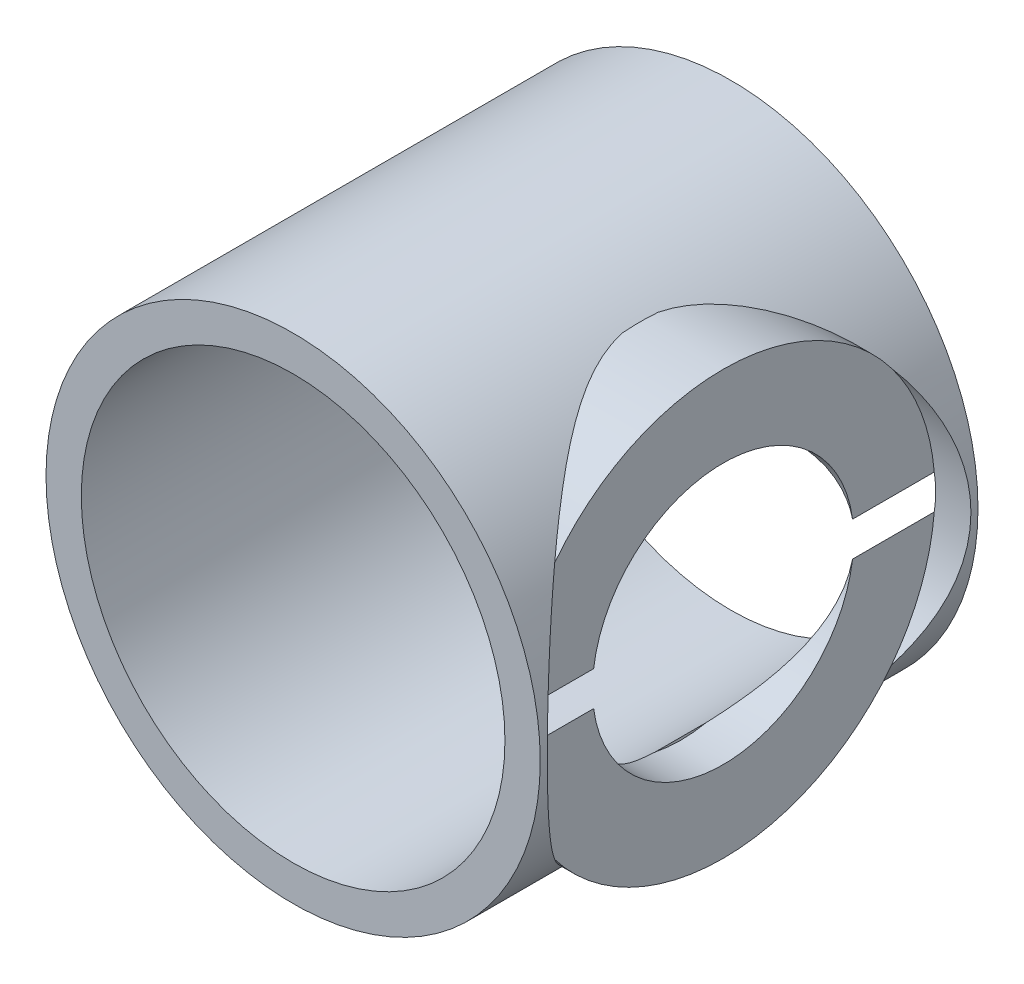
ISO-10303-21;
HEADER;
FILE_DESCRIPTION(('STEP AP214'),'2;1');
FILE_NAME('part.step','',(''),(''),'','','');
FILE_SCHEMA(('AUTOMOTIVE_DESIGN { 1 0 10303 214 1 1 1 1 }'));
ENDSEC;
DATA;
#1=APPLICATION_CONTEXT('core data for automotive mechanical design processes');
#2=APPLICATION_PROTOCOL_DEFINITION('international standard','automotive_design',2000,#1);
#3=PRODUCT_CONTEXT('',#1,'mechanical');
#4=PRODUCT('Part','Part','',(#3));
#5=PRODUCT_RELATED_PRODUCT_CATEGORY('part','',(#4));
#6=PRODUCT_DEFINITION_FORMATION('','',#4);
#7=PRODUCT_DEFINITION_CONTEXT('part definition',#1,'design');
#8=PRODUCT_DEFINITION('design','',#6,#7);
#9=PRODUCT_DEFINITION_SHAPE('','',#8);
#10=(LENGTH_UNIT() NAMED_UNIT(*) SI_UNIT(.MILLI.,.METRE.));
#11=(NAMED_UNIT(*) PLANE_ANGLE_UNIT() SI_UNIT($,.RADIAN.));
#12=(NAMED_UNIT(*) SI_UNIT($,.STERADIAN.) SOLID_ANGLE_UNIT());
#13=UNCERTAINTY_MEASURE_WITH_UNIT(LENGTH_MEASURE(1.E-05),#10,'distance_accuracy_value','');
#14=(GEOMETRIC_REPRESENTATION_CONTEXT(3) GLOBAL_UNCERTAINTY_ASSIGNED_CONTEXT((#13)) GLOBAL_UNIT_ASSIGNED_CONTEXT((#10,
#11,#12)) REPRESENTATION_CONTEXT('',''));
#15=CARTESIAN_POINT('',(0.,0.,0.));
#16=DIRECTION('',(0.,0.,1.));
#17=DIRECTION('',(1.,0.,0.));
#18=AXIS2_PLACEMENT_3D('',#15,#16,#17);
#19=CARTESIAN_POINT('',(0.,0.,78.74));
#20=DIRECTION('',(0.,0.,-1.));
#21=DIRECTION('',(-1.,0.,0.));
#22=AXIS2_PLACEMENT_3D('',#19,#20,#21);
#23=CYLINDRICAL_SURFACE('',#22,38.1);
#24=CARTESIAN_POINT('',(30.353,-23.0283605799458,44.0293598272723));
#25=CARTESIAN_POINT('',(30.4024052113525,-22.9632314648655,44.3512633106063));
#26=CARTESIAN_POINT('',(30.4565027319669,-22.8915020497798,44.6710385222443));
#27=CARTESIAN_POINT('',(30.5733714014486,-22.7351838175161,45.3057598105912));
#28=CARTESIAN_POINT('',(30.6361408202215,-22.6505975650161,45.620706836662));
#29=CARTESIAN_POINT('',(30.8362124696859,-22.3783092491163,46.5566515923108));
#30=CARTESIAN_POINT('',(30.9854386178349,-22.1718697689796,47.1697730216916));
#31=CARTESIAN_POINT('',(31.3084596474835,-21.7133241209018,48.3675442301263));
#32=CARTESIAN_POINT('',(31.482112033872,-21.4614805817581,48.9523344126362));
#33=CARTESIAN_POINT('',(31.8485031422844,-20.9139035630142,50.0949775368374));
#34=CARTESIAN_POINT('',(32.0412487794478,-20.6181541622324,50.6528206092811));
#35=CARTESIAN_POINT('',(32.438775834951,-19.9868508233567,51.7365700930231));
#36=CARTESIAN_POINT('',(32.6434879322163,-19.65151651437,52.2626303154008));
#37=CARTESIAN_POINT('',(33.0603795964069,-18.9417703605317,53.2844267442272));
#38=CARTESIAN_POINT('',(33.272558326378,-18.5673628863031,53.7801663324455));
#39=CARTESIAN_POINT('',(33.6998635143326,-17.7800539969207,54.7411262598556));
#40=CARTESIAN_POINT('',(33.9149962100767,-17.3670548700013,55.2062637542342));
#41=CARTESIAN_POINT('',(34.3428364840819,-16.5048844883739,56.1029214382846));
#42=CARTESIAN_POINT('',(34.5555440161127,-16.0557125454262,56.5344409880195));
#43=CARTESIAN_POINT('',(34.9982966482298,-15.0683419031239,57.4100840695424));
#44=CARTESIAN_POINT('',(35.2274810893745,-14.5258647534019,57.8498368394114));
#45=CARTESIAN_POINT('',(35.6710160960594,-13.3998061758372,58.6819215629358));
#46=CARTESIAN_POINT('',(35.8853643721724,-12.8162184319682,59.0742462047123));
#47=CARTESIAN_POINT('',(36.2927334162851,-11.6124983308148,59.8067291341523));
#48=CARTESIAN_POINT('',(36.4858119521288,-10.9924723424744,60.1470297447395));
#49=CARTESIAN_POINT('',(36.8456946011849,-9.71815649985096,60.7727041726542));
#50=CARTESIAN_POINT('',(37.0125100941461,-9.06388165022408,61.0581017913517));
#51=CARTESIAN_POINT('',(37.2586629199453,-7.97423087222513,61.474971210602));
#52=CARTESIAN_POINT('',(37.3474917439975,-7.54771504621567,61.6242634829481));
#53=CARTESIAN_POINT('',(37.5116038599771,-6.68449509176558,61.898593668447));
#54=CARTESIAN_POINT('',(37.5868912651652,-6.24779410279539,62.0236389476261));
#55=CARTESIAN_POINT('',(37.723083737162,-5.36459865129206,62.2489036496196));
#56=CARTESIAN_POINT('',(37.7839513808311,-4.91808192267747,62.34905850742));
#57=CARTESIAN_POINT('',(37.8902652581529,-4.01796512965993,62.5234372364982));
#58=CARTESIAN_POINT('',(37.9357034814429,-3.56436151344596,62.597647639));
#59=CARTESIAN_POINT('',(37.973,-3.10825851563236,62.6584897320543));
#60=B_SPLINE_CURVE_WITH_KNOTS('',3,(#24,#25,#26,#27,#28,#29,#30,#31,#32,#33,#34,#35,#36,#37,#38,
#39,#40,#41,#42,#43,#44,#45,#46,#47,#48,#49,#50,#51,#52,#53,#54,#55,#56,#57,#58,#59),
.UNSPECIFIED.,.F.,.F.,(4,2,2,2,2,2,2,2,2,2,2,2,2,2,2,2,2,4),(0.,0.996131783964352,
1.99206512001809,3.9807851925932,5.95835096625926,7.93663560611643,9.90441886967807,
11.8719822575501,13.8446698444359,15.8173949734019,18.0195481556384,20.2220404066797,
22.4183950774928,24.6137954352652,25.9945659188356,27.374916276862,28.758810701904,
30.1434224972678),.UNSPECIFIED.);
#61=CARTESIAN_POINT('',(30.353,-23.0283605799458,44.0293598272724));
#62=VERTEX_POINT('',#61);
#63=CARTESIAN_POINT('',(37.973,-3.10825851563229,62.6584897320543));
#64=VERTEX_POINT('',#63);
#65=EDGE_CURVE('E49',#62,#64,#60,.T.);
#66=ORIENTED_EDGE('',*,*,#65,.F.);
#67=DIRECTION('',(0.,0.,-1.));
#68=VECTOR('',#67,1.);
#69=CARTESIAN_POINT('',(30.353,-23.0283605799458,78.74));
#70=LINE('',#69,#68);
#71=CARTESIAN_POINT('',(30.353,-23.0283605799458,34.7106401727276));
#72=VERTEX_POINT('',#71);
#73=EDGE_CURVE('E11',#62,#72,#70,.T.);
#74=ORIENTED_EDGE('',*,*,#73,.T.);
#75=CARTESIAN_POINT('',(37.973,-3.10825851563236,16.0815102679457));
#76=CARTESIAN_POINT('',(37.9474390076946,-3.4206348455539,16.1231949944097));
#77=CARTESIAN_POINT('',(37.9180758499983,-3.73185335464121,16.1711367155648));
#78=CARTESIAN_POINT('',(37.8519848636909,-4.35133286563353,16.2793158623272));
#79=CARTESIAN_POINT('',(37.8152576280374,-4.65959410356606,16.3395522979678));
#80=CARTESIAN_POINT('',(37.7347056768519,-5.2723263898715,16.4720571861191));
#81=CARTESIAN_POINT('',(37.6908865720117,-5.57680023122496,16.5443161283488));
#82=CARTESIAN_POINT('',(37.5964278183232,-6.1816134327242,16.7006313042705));
#83=CARTESIAN_POINT('',(37.54578805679,-6.48195272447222,16.7846877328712));
#84=CARTESIAN_POINT('',(37.3848489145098,-7.3718718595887,17.05291150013));
#85=CARTESIAN_POINT('',(37.2649491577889,-7.95471276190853,17.2540815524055));
#86=CARTESIAN_POINT('',(37.0023588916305,-9.09835016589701,17.6994691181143));
#87=CARTESIAN_POINT('',(36.859664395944,-9.65914279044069,17.9436941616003));
#88=CARTESIAN_POINT('',(36.555205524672,-10.754011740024,18.4718067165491));
#89=CARTESIAN_POINT('',(36.3935021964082,-11.2881661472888,18.7555677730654));
#90=CARTESIAN_POINT('',(36.0541211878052,-12.3292398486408,19.3608155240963));
#91=CARTESIAN_POINT('',(35.8764441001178,-12.8361601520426,19.6823008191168));
#92=CARTESIAN_POINT('',(35.5082433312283,-13.8221669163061,20.3615275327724));
#93=CARTESIAN_POINT('',(35.3176887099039,-14.3011807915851,20.7193573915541));
#94=CARTESIAN_POINT('',(34.9278715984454,-15.2284866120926,21.4685039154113));
#95=CARTESIAN_POINT('',(34.7286085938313,-15.6767767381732,21.8598225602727));
#96=CARTESIAN_POINT('',(34.3043537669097,-16.5860895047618,22.7162879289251));
#97=CARTESIAN_POINT('',(34.078834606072,-17.0436224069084,23.1848834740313));
#98=CARTESIAN_POINT('',(33.6273461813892,-17.9179719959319,24.1585081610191));
#99=CARTESIAN_POINT('',(33.4013768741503,-18.3347845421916,24.6635409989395));
#100=CARTESIAN_POINT('',(32.9552465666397,-19.1250409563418,25.7070815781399));
#101=CARTESIAN_POINT('',(32.7350746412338,-19.4985717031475,26.2455188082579));
#102=CARTESIAN_POINT('',(32.3062375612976,-20.2011475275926,27.3550223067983));
#103=CARTESIAN_POINT('',(32.0975710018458,-20.5301980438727,27.9260845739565));
#104=CARTESIAN_POINT('',(31.7349808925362,-21.0853009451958,28.9913344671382));
#105=CARTESIAN_POINT('',(31.5780337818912,-21.3191772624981,29.4804269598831));
#106=CARTESIAN_POINT('',(31.280083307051,-21.753982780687,30.4775874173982));
#107=CARTESIAN_POINT('',(31.1390742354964,-21.9549237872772,30.9856485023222));
#108=CARTESIAN_POINT('',(30.876396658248,-22.3228513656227,32.0209879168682));
#109=CARTESIAN_POINT('',(30.7547975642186,-22.4897166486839,32.5483272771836));
#110=CARTESIAN_POINT('',(30.5351932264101,-22.7869553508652,33.6185635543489));
#111=CARTESIAN_POINT('',(30.4372124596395,-22.9172909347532,34.1614759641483));
#112=CARTESIAN_POINT('',(30.353,-23.0283605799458,34.7106401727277));
#113=B_SPLINE_CURVE_WITH_KNOTS('',3,(#75,#76,#77,#78,#79,#80,#81,#82,#83,#84,#85,#86,#87,#88,
#89,#90,#91,#92,#93,#94,#95,#96,#97,#98,#99,#100,#101,#102,#103,#104,#105,#106,#107,#108,#109,
#110,#111,#112),.UNSPECIFIED.,.F.,.F.,(4,2,2,2,2,2,2,2,2,2,2,2,2,2,2,2,2,2,4),(0.,
0.948435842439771,1.89679534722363,2.84440819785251,3.79203670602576,5.67384384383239,
7.55598042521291,9.43222963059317,11.3084092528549,13.1892689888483,15.0702399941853,
17.1460173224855,19.2220055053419,21.2937516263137,23.365244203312,25.057044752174,
26.7482375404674,28.4453488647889,30.1442115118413),.UNSPECIFIED.);
#114=CARTESIAN_POINT('',(37.973,-3.10825851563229,16.0815102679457));
#115=VERTEX_POINT('',#114);
#116=EDGE_CURVE('E126',#115,#72,#113,.T.);
#117=ORIENTED_EDGE('',*,*,#116,.F.);
#118=DIRECTION('',(0.,0.,-1.));
#119=VECTOR('',#118,1.);
#120=CARTESIAN_POINT('',(37.973,-3.10825851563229,78.74));
#121=LINE('',#120,#119);
#122=CARTESIAN_POINT('',(37.973,-3.10825851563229,1.39700000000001));
#123=VERTEX_POINT('',#122);
#124=EDGE_CURVE('E173',#115,#123,#121,.T.);
#125=ORIENTED_EDGE('',*,*,#124,.T.);
#126=CARTESIAN_POINT('',(0.,0.,39.37));
#127=DIRECTION('',(-0.707106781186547,0.,-0.707106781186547));
#128=DIRECTION('',(0.707106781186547,0.,-0.707106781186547));
#129=AXIS2_PLACEMENT_3D('',#126,#127,#128);
#130=ELLIPSE('',#129,53.8815367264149,38.1);
#131=CARTESIAN_POINT('',(37.973,3.10825851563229,1.39700000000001));
#132=VERTEX_POINT('',#131);
#133=EDGE_CURVE('E180',#132,#123,#130,.T.);
#134=ORIENTED_EDGE('',*,*,#133,.F.);
#135=DIRECTION('',(0.,0.,-1.));
#136=VECTOR('',#135,1.);
#137=CARTESIAN_POINT('',(37.973,3.10825851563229,78.74));
#138=LINE('',#137,#136);
#139=CARTESIAN_POINT('',(37.973,3.10825851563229,16.0815102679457));
#140=VERTEX_POINT('',#139);
#141=EDGE_CURVE('E125',#132,#140,#138,.F.);
#142=ORIENTED_EDGE('',*,*,#141,.T.);
#143=CARTESIAN_POINT('',(30.353,23.0283605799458,34.7106401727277));
#144=CARTESIAN_POINT('',(30.4024052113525,22.9632314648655,34.3887366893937));
#145=CARTESIAN_POINT('',(30.4565027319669,22.8915020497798,34.0689614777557));
#146=CARTESIAN_POINT('',(30.5733714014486,22.7351838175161,33.4342401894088));
#147=CARTESIAN_POINT('',(30.6361408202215,22.6505975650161,33.119293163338));
#148=CARTESIAN_POINT('',(30.8362124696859,22.3783092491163,32.1833484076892));
#149=CARTESIAN_POINT('',(30.9854386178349,22.1718697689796,31.5702269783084));
#150=CARTESIAN_POINT('',(31.3084596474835,21.7133241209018,30.3724557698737));
#151=CARTESIAN_POINT('',(31.482112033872,21.4614805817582,29.7876655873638));
#152=CARTESIAN_POINT('',(31.8485031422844,20.9139035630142,28.6450224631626));
#153=CARTESIAN_POINT('',(32.0412487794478,20.6181541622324,28.0871793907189));
#154=CARTESIAN_POINT('',(32.438775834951,19.9868508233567,27.0034299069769));
#155=CARTESIAN_POINT('',(32.6434879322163,19.65151651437,26.4773696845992));
#156=CARTESIAN_POINT('',(33.0603795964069,18.9417703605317,25.4555732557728));
#157=CARTESIAN_POINT('',(33.272558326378,18.5673628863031,24.9598336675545));
#158=CARTESIAN_POINT('',(33.6998635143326,17.7800539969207,23.9988737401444));
#159=CARTESIAN_POINT('',(33.9149962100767,17.3670548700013,23.5337362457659));
#160=CARTESIAN_POINT('',(34.3428364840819,16.5048844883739,22.6370785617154));
#161=CARTESIAN_POINT('',(34.5555440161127,16.0557125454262,22.2055590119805));
#162=CARTESIAN_POINT('',(34.9982966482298,15.0683419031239,21.3299159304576));
#163=CARTESIAN_POINT('',(35.2274810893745,14.525864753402,20.8901631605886));
#164=CARTESIAN_POINT('',(35.6710160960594,13.3998061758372,20.0580784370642));
#165=CARTESIAN_POINT('',(35.8853643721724,12.8162184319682,19.6657537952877));
#166=CARTESIAN_POINT('',(36.2927334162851,11.6124983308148,18.9332708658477));
#167=CARTESIAN_POINT('',(36.4858119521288,10.9924723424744,18.5929702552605));
#168=CARTESIAN_POINT('',(36.8456946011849,9.71815649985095,17.9672958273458));
#169=CARTESIAN_POINT('',(37.0125100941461,9.06388165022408,17.6818982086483));
#170=CARTESIAN_POINT('',(37.2586629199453,7.97423087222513,17.265028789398));
#171=CARTESIAN_POINT('',(37.3474917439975,7.54771504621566,17.1157365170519));
#172=CARTESIAN_POINT('',(37.5116038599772,6.68449509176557,16.841406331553));
#173=CARTESIAN_POINT('',(37.5868912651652,6.24779410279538,16.7163610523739));
#174=CARTESIAN_POINT('',(37.723083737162,5.36459865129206,16.4910963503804));
#175=CARTESIAN_POINT('',(37.7839513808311,4.91808192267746,16.39094149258));
#176=CARTESIAN_POINT('',(37.8902652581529,4.01796512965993,16.2165627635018));
#177=CARTESIAN_POINT('',(37.9357034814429,3.56436151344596,16.142352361));
#178=CARTESIAN_POINT('',(37.973,3.10825851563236,16.0815102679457));
#179=B_SPLINE_CURVE_WITH_KNOTS('',3,(#143,#144,#145,#146,#147,#148,#149,#150,#151,#152,#153,
#154,#155,#156,#157,#158,#159,#160,#161,#162,#163,#164,#165,#166,#167,#168,#169,#170,#171,#172,
#173,#174,#175,#176,#177,#178),.UNSPECIFIED.,.F.,.F.,(4,2,2,2,2,2,2,2,2,2,2,2,2,2,2,2,2,4),(0.,
0.996131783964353,1.99206512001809,3.98078519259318,5.95835096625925,7.93663560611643,
9.90441886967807,11.8719822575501,13.8446698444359,15.8173949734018,18.0195481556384,
20.2220404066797,22.4183950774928,24.6137954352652,25.9945659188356,27.374916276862,
28.758810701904,30.1434224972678),.UNSPECIFIED.);
#180=CARTESIAN_POINT('',(30.353,23.0283605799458,34.7106401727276));
#181=VERTEX_POINT('',#180);
#182=EDGE_CURVE('E57',#181,#140,#179,.T.);
#183=ORIENTED_EDGE('',*,*,#182,.F.);
#184=DIRECTION('',(0.,0.,-1.));
#185=VECTOR('',#184,1.);
#186=CARTESIAN_POINT('',(30.353,23.0283605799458,78.74));
#187=LINE('',#186,#185);
#188=CARTESIAN_POINT('',(30.353,23.0283605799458,44.0293598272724));
#189=VERTEX_POINT('',#188);
#190=EDGE_CURVE('E42',#181,#189,#187,.F.);
#191=ORIENTED_EDGE('',*,*,#190,.T.);
#192=CARTESIAN_POINT('',(37.973,3.10825851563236,62.6584897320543));
#193=CARTESIAN_POINT('',(37.9474390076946,3.4206348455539,62.6168050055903));
#194=CARTESIAN_POINT('',(37.9180758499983,3.73185335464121,62.5688632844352));
#195=CARTESIAN_POINT('',(37.8519848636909,4.35133286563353,62.4606841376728));
#196=CARTESIAN_POINT('',(37.8152576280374,4.65959410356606,62.4004477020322));
#197=CARTESIAN_POINT('',(37.7347056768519,5.2723263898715,62.2679428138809));
#198=CARTESIAN_POINT('',(37.6908865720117,5.57680023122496,62.1956838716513));
#199=CARTESIAN_POINT('',(37.5964278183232,6.1816134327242,62.0393686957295));
#200=CARTESIAN_POINT('',(37.54578805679,6.48195272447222,61.9553122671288));
#201=CARTESIAN_POINT('',(37.3848489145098,7.3718718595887,61.68708849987));
#202=CARTESIAN_POINT('',(37.2649491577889,7.95471276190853,61.4859184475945));
#203=CARTESIAN_POINT('',(37.0023588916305,9.098350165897,61.0405308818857));
#204=CARTESIAN_POINT('',(36.859664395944,9.65914279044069,60.7963058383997));
#205=CARTESIAN_POINT('',(36.555205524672,10.754011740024,60.2681932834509));
#206=CARTESIAN_POINT('',(36.3935021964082,11.2881661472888,59.9844322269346));
#207=CARTESIAN_POINT('',(36.0541211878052,12.3292398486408,59.3791844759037));
#208=CARTESIAN_POINT('',(35.8764441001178,12.8361601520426,59.0576991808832));
#209=CARTESIAN_POINT('',(35.5082433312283,13.8221669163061,58.3784724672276));
#210=CARTESIAN_POINT('',(35.3176887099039,14.3011807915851,58.0206426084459));
#211=CARTESIAN_POINT('',(34.9278715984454,15.2284866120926,57.2714960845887));
#212=CARTESIAN_POINT('',(34.7286085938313,15.6767767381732,56.8801774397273));
#213=CARTESIAN_POINT('',(34.3043537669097,16.5860895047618,56.0237120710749));
#214=CARTESIAN_POINT('',(34.078834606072,17.0436224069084,55.5551165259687));
#215=CARTESIAN_POINT('',(33.6273461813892,17.9179719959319,54.5814918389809));
#216=CARTESIAN_POINT('',(33.4013768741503,18.3347845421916,54.0764590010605));
#217=CARTESIAN_POINT('',(32.9552465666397,19.1250409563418,53.0329184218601));
#218=CARTESIAN_POINT('',(32.7350746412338,19.4985717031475,52.4944811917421));
#219=CARTESIAN_POINT('',(32.3062375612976,20.2011475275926,51.3849776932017));
#220=CARTESIAN_POINT('',(32.0975710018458,20.5301980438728,50.8139154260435));
#221=CARTESIAN_POINT('',(31.7349808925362,21.0853009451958,49.7486655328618));
#222=CARTESIAN_POINT('',(31.5780337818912,21.3191772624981,49.2595730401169));
#223=CARTESIAN_POINT('',(31.280083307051,21.753982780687,48.2624125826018));
#224=CARTESIAN_POINT('',(31.1390742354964,21.9549237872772,47.7543514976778));
#225=CARTESIAN_POINT('',(30.876396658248,22.3228513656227,46.7190120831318));
#226=CARTESIAN_POINT('',(30.7547975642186,22.4897166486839,46.1916727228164));
#227=CARTESIAN_POINT('',(30.5351932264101,22.7869553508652,45.1214364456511));
#228=CARTESIAN_POINT('',(30.4372124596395,22.9172909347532,44.5785240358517));
#229=CARTESIAN_POINT('',(30.353,23.0283605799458,44.0293598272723));
#230=B_SPLINE_CURVE_WITH_KNOTS('',3,(#192,#193,#194,#195,#196,#197,#198,#199,#200,#201,#202,
#203,#204,#205,#206,#207,#208,#209,#210,#211,#212,#213,#214,#215,#216,#217,#218,#219,#220,#221,
#222,#223,#224,#225,#226,#227,#228,#229),.UNSPECIFIED.,.F.,.F.,(4,2,2,2,2,2,2,2,2,2,2,2,2,2,2,2,
2,2,4),(0.,0.948435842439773,1.89679534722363,2.84440819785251,3.79203670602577,
5.67384384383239,7.55598042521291,9.43222963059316,11.3084092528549,13.1892689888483,
15.0702399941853,17.1460173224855,19.2220055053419,21.2937516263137,23.365244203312,
25.057044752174,26.7482375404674,28.4453488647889,30.1442115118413),.UNSPECIFIED.);
#231=CARTESIAN_POINT('',(37.973,3.10825851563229,62.6584897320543));
#232=VERTEX_POINT('',#231);
#233=EDGE_CURVE('E119',#232,#189,#230,.T.);
#234=ORIENTED_EDGE('',*,*,#233,.F.);
#235=CARTESIAN_POINT('',(37.973,3.10825851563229,77.343));
#236=VERTEX_POINT('',#235);
#237=EDGE_CURVE('E181',#232,#236,#138,.F.);
#238=ORIENTED_EDGE('',*,*,#237,.T.);
#239=CARTESIAN_POINT('',(0.,0.,39.37));
#240=DIRECTION('',(0.707106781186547,0.,-0.707106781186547));
#241=DIRECTION('',(-0.707106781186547,0.,-0.707106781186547));
#242=AXIS2_PLACEMENT_3D('',#239,#240,#241);
#243=ELLIPSE('',#242,53.8815367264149,38.1);
#244=CARTESIAN_POINT('',(37.973,-3.10825851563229,77.343));
#245=VERTEX_POINT('',#244);
#246=EDGE_CURVE('E185',#245,#236,#243,.F.);
#247=ORIENTED_EDGE('',*,*,#246,.F.);
#248=EDGE_CURVE('E178',#245,#64,#121,.T.);
#249=ORIENTED_EDGE('',*,*,#248,.T.);
#250=EDGE_LOOP('',(#66,#74,#117,#125,#134,#142,#183,#191,#234,#238,#247,#249));
#251=FACE_BOUND('',#250,.T.);
#252=CARTESIAN_POINT('',(0.,0.,78.74));
#253=DIRECTION('',(0.,0.,1.));
#254=DIRECTION('',(1.,0.,0.));
#255=AXIS2_PLACEMENT_3D('',#252,#253,#254);
#256=CIRCLE('',#255,38.1);
#257=CARTESIAN_POINT('',(38.1,0.,78.74));
#258=VERTEX_POINT('',#257);
#259=EDGE_CURVE('E230',#258,#258,#256,.T.);
#260=ORIENTED_EDGE('',*,*,#259,.T.);
#261=EDGE_LOOP('',(#260));
#262=FACE_BOUND('',#261,.T.);
#263=CARTESIAN_POINT('',(0.,0.,0.));
#264=DIRECTION('',(0.,0.,1.));
#265=DIRECTION('',(1.,0.,0.));
#266=AXIS2_PLACEMENT_3D('',#263,#264,#265);
#267=CIRCLE('',#266,38.1);
#268=CARTESIAN_POINT('',(38.1,0.,0.));
#269=VERTEX_POINT('',#268);
#270=EDGE_CURVE('E234',#269,#269,#267,.T.);
#271=ORIENTED_EDGE('',*,*,#270,.F.);
#272=EDGE_LOOP('',(#271));
#273=FACE_BOUND('',#272,.T.);
#274=ADVANCED_FACE('F33',(#251,#262,#273),#23,.F.);
#275=CARTESIAN_POINT('',(23.114,0.,39.37));
#276=DIRECTION('',(1.,0.,0.));
#277=DIRECTION('',(0.,0.,-1.));
#278=AXIS2_PLACEMENT_3D('',#275,#276,#277);
#279=CYLINDRICAL_SURFACE('',#278,38.1);
#280=CARTESIAN_POINT('',(23.114,37.9676902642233,36.1975410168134));
#281=CARTESIAN_POINT('',(23.1672799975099,37.9352422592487,35.8090522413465));
#282=CARTESIAN_POINT('',(23.2299966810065,37.8969201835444,35.4224216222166));
#283=CARTESIAN_POINT('',(23.3728973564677,37.8089598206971,34.6538763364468));
#284=CARTESIAN_POINT('',(23.453073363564,37.7593267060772,34.2719595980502));
#285=CARTESIAN_POINT('',(23.6292563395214,37.6493215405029,33.5146952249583));
#286=CARTESIAN_POINT('',(23.7252119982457,37.5889842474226,33.1393305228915));
#287=CARTESIAN_POINT('',(23.931628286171,37.4579049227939,32.3944426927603));
#288=CARTESIAN_POINT('',(24.0420906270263,37.3871616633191,32.0249202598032));
#289=CARTESIAN_POINT('',(24.3901581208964,37.1617863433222,30.9344716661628));
#290=CARTESIAN_POINT('',(24.6466515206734,36.9926545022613,30.2224873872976));
#291=CARTESIAN_POINT('',(25.1994091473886,36.6183517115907,28.8233569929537));
#292=CARTESIAN_POINT('',(25.495713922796,36.4131439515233,28.1362371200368));
#293=CARTESIAN_POINT('',(26.0473391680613,36.0197987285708,26.9408154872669));
#294=CARTESIAN_POINT('',(26.2966105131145,35.8384289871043,26.427448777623));
#295=CARTESIAN_POINT('',(26.8093561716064,35.4564958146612,25.4150848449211));
#296=CARTESIAN_POINT('',(27.0728322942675,35.255929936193,24.9160894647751));
#297=CARTESIAN_POINT('',(27.6108047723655,34.836222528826,23.9319356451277));
#298=CARTESIAN_POINT('',(27.8853033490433,34.6170772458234,23.4467800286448));
#299=CARTESIAN_POINT('',(28.4425351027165,34.1607143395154,22.4899368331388));
#300=CARTESIAN_POINT('',(28.7252679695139,33.9234973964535,22.0182487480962));
#301=CARTESIAN_POINT('',(29.2988021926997,33.4294334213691,21.0843730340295));
#302=CARTESIAN_POINT('',(29.5896484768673,33.1724511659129,20.6222845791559));
#303=CARTESIAN_POINT('',(30.17526408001,32.6406571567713,19.7110132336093));
#304=CARTESIAN_POINT('',(30.470033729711,32.3658438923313,19.2618314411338));
#305=CARTESIAN_POINT('',(31.3572750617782,31.5149904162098,17.9335437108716));
#306=CARTESIAN_POINT('',(31.9528863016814,30.9123601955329,17.0733628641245));
#307=CARTESIAN_POINT('',(33.1743983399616,29.5992045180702,15.3547130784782));
#308=CARTESIAN_POINT('',(33.8000265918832,28.8844237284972,14.4993040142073));
#309=CARTESIAN_POINT('',(35.0334321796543,27.3753750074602,12.8473593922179));
#310=CARTESIAN_POINT('',(35.6412070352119,26.5810960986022,12.050831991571));
#311=CARTESIAN_POINT('',(36.8247032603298,24.9155238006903,10.5238926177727));
#312=CARTESIAN_POINT('',(37.4005310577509,24.0445147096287,9.79325532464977));
#313=CARTESIAN_POINT('',(38.2326822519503,22.6792567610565,8.74992138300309));
#314=CARTESIAN_POINT('',(38.5047748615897,22.2144302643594,8.41094550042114));
#315=CARTESIAN_POINT('',(39.0370778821,21.2651174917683,7.75135138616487));
#316=CARTESIAN_POINT('',(39.2972853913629,20.780626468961,7.43073763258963));
#317=CARTESIAN_POINT('',(39.9307980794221,19.5455137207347,6.65381152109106));
#318=CARTESIAN_POINT('',(40.2956951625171,18.7828085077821,6.20968394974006));
#319=CARTESIAN_POINT('',(40.9896568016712,17.2158241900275,5.36977373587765));
#320=CARTESIAN_POINT('',(41.3187300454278,16.4115552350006,4.97397936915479));
#321=CARTESIAN_POINT('',(41.9356766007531,14.7639764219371,4.23526322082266));
#322=CARTESIAN_POINT('',(42.2235589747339,13.9206752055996,3.89232980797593));
#323=CARTESIAN_POINT('',(42.7528443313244,12.1986831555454,3.2640189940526));
#324=CARTESIAN_POINT('',(42.9942498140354,11.3199942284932,2.97863849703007));
#325=CARTESIAN_POINT('',(43.4107262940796,9.59397484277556,2.48756001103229));
#326=CARTESIAN_POINT('',(43.5892192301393,8.7486483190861,2.27772971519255));
#327=CARTESIAN_POINT('',(43.8980299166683,7.03714392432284,1.91531351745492));
#328=CARTESIAN_POINT('',(44.0283507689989,6.17096739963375,1.76272392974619));
#329=CARTESIAN_POINT('',(44.2379961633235,4.42440892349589,1.51749869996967));
#330=CARTESIAN_POINT('',(44.3173426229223,3.54403324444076,1.42483729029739));
#331=CARTESIAN_POINT('',(44.4233450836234,1.7757736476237,1.30108733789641));
#332=CARTESIAN_POINT('',(44.4500004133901,0.887889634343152,1.26999957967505));
#333=CARTESIAN_POINT('',(44.4499995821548,-0.897458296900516,1.27000042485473));
#334=CARTESIAN_POINT('',(44.4227657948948,-1.79492233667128,1.30176270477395));
#335=CARTESIAN_POINT('',(44.3144725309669,-3.58211535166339,1.42818884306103));
#336=CARTESIAN_POINT('',(44.2334123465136,-4.47184422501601,1.52285352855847));
#337=CARTESIAN_POINT('',(44.019282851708,-6.236647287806,1.77333817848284));
#338=CARTESIAN_POINT('',(43.8861909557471,-7.11171494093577,1.9291847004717));
#339=CARTESIAN_POINT('',(43.5708974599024,-8.84032837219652,2.29925704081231));
#340=CARTESIAN_POINT('',(43.3886949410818,-9.69387374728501,2.51348395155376));
#341=CARTESIAN_POINT('',(42.9800877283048,-11.3689704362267,2.99539820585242));
#342=CARTESIAN_POINT('',(42.7539532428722,-12.1906822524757,3.26275896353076));
#343=CARTESIAN_POINT('',(42.2609148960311,-13.8032054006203,3.84793275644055));
#344=CARTESIAN_POINT('',(41.9940120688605,-14.5940175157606,4.16574451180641));
#345=CARTESIAN_POINT('',(41.4238528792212,-16.1414637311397,4.84786025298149));
#346=CARTESIAN_POINT('',(41.1206024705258,-16.8981034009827,5.2121566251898));
#347=CARTESIAN_POINT('',(40.4820608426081,-18.3753333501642,5.9836011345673));
#348=CARTESIAN_POINT('',(40.1467626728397,-19.095915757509,6.39075856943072));
#349=CARTESIAN_POINT('',(39.5570322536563,-20.2814152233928,7.11174637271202));
#350=CARTESIAN_POINT('',(39.3098156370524,-20.7562473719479,7.41530274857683));
#351=CARTESIAN_POINT('',(38.8037450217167,-21.6876172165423,8.03995692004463));
#352=CARTESIAN_POINT('',(38.5448934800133,-22.1441587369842,8.36105101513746));
#353=CARTESIAN_POINT('',(37.7526727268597,-23.4865447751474,9.34954701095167));
#354=CARTESIAN_POINT('',(37.2037305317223,-24.3449654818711,10.0420492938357));
#355=CARTESIAN_POINT('',(36.0733356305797,-25.9907235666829,11.489923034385));
#356=CARTESIAN_POINT('',(35.4917661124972,-26.7777751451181,12.2455258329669));
#357=CARTESIAN_POINT('',(34.3089176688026,-28.2774202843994,13.8127367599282));
#358=CARTESIAN_POINT('',(33.7076406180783,-28.9900209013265,14.6243395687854));
#359=CARTESIAN_POINT('',(32.4831213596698,-30.3563640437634,16.3197695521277));
#360=CARTESIAN_POINT('',(31.8596881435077,-31.0084433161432,17.2048022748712));
#361=CARTESIAN_POINT('',(30.9283555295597,-31.9285176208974,18.5738011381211));
#362=CARTESIAN_POINT('',(30.6184821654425,-32.2255918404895,19.0371451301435));
#363=CARTESIAN_POINT('',(30.0020236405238,-32.8002820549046,19.9778536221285));
#364=CARTESIAN_POINT('',(29.6954381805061,-33.0778998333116,20.4552168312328));
#365=CARTESIAN_POINT('',(29.090060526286,-33.6114932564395,21.4206425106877));
#366=CARTESIAN_POINT('',(28.7912272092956,-33.8676151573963,21.9085983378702));
#367=CARTESIAN_POINT('',(28.2015168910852,-34.3602172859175,22.899073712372));
#368=CARTESIAN_POINT('',(27.9106402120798,-34.5966967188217,23.4015938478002));
#369=CARTESIAN_POINT('',(27.3398605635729,-35.0494960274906,24.4216172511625));
#370=CARTESIAN_POINT('',(27.0599554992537,-35.2658197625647,24.9391176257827));
#371=CARTESIAN_POINT('',(26.5145898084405,-35.6776654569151,25.9896992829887));
#372=CARTESIAN_POINT('',(26.2491272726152,-35.8731901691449,26.5227784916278));
#373=CARTESIAN_POINT('',(25.660325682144,-36.2976310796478,27.766420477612));
#374=CARTESIAN_POINT('',(25.343300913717,-36.5191450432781,28.4825514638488));
#375=CARTESIAN_POINT('',(24.7514153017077,-36.9228688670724,29.9421687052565));
#376=CARTESIAN_POINT('',(24.4765066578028,-37.1051233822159,30.6856227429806));
#377=CARTESIAN_POINT('',(24.1035478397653,-37.347609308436,31.8254983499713));
#378=CARTESIAN_POINT('',(23.9851978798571,-37.4236552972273,32.2120033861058));
#379=CARTESIAN_POINT('',(23.764215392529,-37.5643672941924,32.9915100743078));
#380=CARTESIAN_POINT('',(23.661580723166,-37.6290348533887,33.3845108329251));
#381=CARTESIAN_POINT('',(23.4734312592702,-37.7466949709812,34.1778617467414));
#382=CARTESIAN_POINT('',(23.3879789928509,-37.7996449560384,34.5782331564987));
#383=CARTESIAN_POINT('',(23.2362116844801,-37.8931211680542,35.3842297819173));
#384=CARTESIAN_POINT('',(23.1699067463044,-37.9336408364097,35.7898576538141));
#385=CARTESIAN_POINT('',(23.114,-37.9676902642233,36.1975410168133));
#386=B_SPLINE_CURVE_WITH_KNOTS('',3,(#280,#281,#282,#283,#284,#285,#286,#287,#288,#289,#290,
#291,#292,#293,#294,#295,#296,#297,#298,#299,#300,#301,#302,#303,#304,#305,#306,#307,#308,#309,
#310,#311,#312,#313,#314,#315,#316,#317,#318,#319,#320,#321,#322,#323,#324,#325,#326,#327,#328,
#329,#330,#331,#332,#333,#334,#335,#336,#337,#338,#339,#340,#341,#342,#343,#344,#345,#346,#347,
#348,#349,#350,#351,#352,#353,#354,#355,#356,#357,#358,#359,#360,#361,#362,#363,#364,#365,#366,
#367,#368,#369,#370,#371,#372,#373,#374,#375,#376,#377,#378,#379,#380,#381,#382,#383,#384,#385),
.UNSPECIFIED.,.F.,.F.,(4,2,2,2,2,2,2,2,2,2,2,2,2,2,2,2,2,2,2,2,2,2,2,2,2,2,2,2,2,2,2,2,2,2,2,2,
2,2,2,2,2,2,2,2,2,2,2,2,2,2,2,2,4),(0.,1.18012952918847,2.35972046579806,3.5355489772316,
4.71151635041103,7.03495351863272,9.36077533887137,11.1565460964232,12.9525461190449,
14.7489099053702,16.545206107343,18.3551246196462,20.1651966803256,23.7840549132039,
27.615180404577,31.4468356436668,35.2648474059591,37.1734655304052,39.0825471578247,
41.9449360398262,44.8066292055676,47.6676917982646,50.5286004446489,53.1926090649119,
55.856446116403,58.5191370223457,61.1818618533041,63.8732824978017,66.5647385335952,
69.2573641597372,71.9500401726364,74.6266509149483,77.3031937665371,79.9792987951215,
82.6559855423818,84.5015963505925,86.3468192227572,90.0379714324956,93.7433063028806,
97.4482896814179,101.235744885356,103.130276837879,105.024634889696,106.904833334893,
108.785107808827,110.665021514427,112.544686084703,114.984253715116,117.42103167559,
118.654538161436,119.887876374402,121.125624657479,122.364024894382),.UNSPECIFIED.);
#387=CARTESIAN_POINT('',(37.973,-23.1052758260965,9.07550827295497));
#388=VERTEX_POINT('',#387);
#389=CARTESIAN_POINT('',(23.114,-37.9676902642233,36.1975410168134));
#390=VERTEX_POINT('',#389);
#391=EDGE_CURVE('E198',#388,#390,#386,.T.);
#392=ORIENTED_EDGE('',*,*,#391,.F.);
#393=CARTESIAN_POINT('',(37.973,0.,39.37));
#394=DIRECTION('',(1.,0.,0.));
#395=DIRECTION('',(0.,0.,-1.));
#396=AXIS2_PLACEMENT_3D('',#393,#394,#395);
#397=CIRCLE('',#396,38.1);
#398=CARTESIAN_POINT('',(37.973,-23.1052758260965,69.664491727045));
#399=VERTEX_POINT('',#398);
#400=EDGE_CURVE('E260',#399,#388,#397,.T.);
#401=ORIENTED_EDGE('',*,*,#400,.F.);
#402=CARTESIAN_POINT('',(23.114,-37.9676902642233,42.5424589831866));
#403=CARTESIAN_POINT('',(23.1672797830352,-37.9352423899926,42.9309461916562));
#404=CARTESIAN_POINT('',(23.2299961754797,-37.8969204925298,43.3175752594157));
#405=CARTESIAN_POINT('',(23.3728961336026,-37.8089605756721,44.0861174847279));
#406=CARTESIAN_POINT('',(23.4530717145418,-37.7593277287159,44.4680327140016));
#407=CARTESIAN_POINT('',(23.6292537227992,-37.6493231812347,45.2252941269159));
#408=CARTESIAN_POINT('',(23.7252088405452,-37.5889862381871,45.6006573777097));
#409=CARTESIAN_POINT('',(23.9316239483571,-37.4579076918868,46.3455423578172));
#410=CARTESIAN_POINT('',(24.0420856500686,-37.3871648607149,46.7150633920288));
#411=CARTESIAN_POINT('',(24.3901529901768,-37.1617897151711,47.8055137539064));
#412=CARTESIAN_POINT('',(24.6466471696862,-36.992657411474,48.5175010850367));
#413=CARTESIAN_POINT('',(25.1994067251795,-36.6183533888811,49.9166373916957));
#414=CARTESIAN_POINT('',(25.4957126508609,-36.4131448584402,50.6037601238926));
#415=CARTESIAN_POINT('',(26.0473393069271,-36.0197986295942,51.7991848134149));
#416=CARTESIAN_POINT('',(26.2966108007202,-35.8384287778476,52.3125518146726));
#417=CARTESIAN_POINT('',(26.8093567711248,-35.4564953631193,53.3249163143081));
#418=CARTESIAN_POINT('',(27.0728330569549,-35.2559293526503,53.823911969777));
#419=CARTESIAN_POINT('',(27.6108058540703,-34.8362216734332,54.8080662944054));
#420=CARTESIAN_POINT('',(27.885304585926,-34.6170762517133,55.2932221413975));
#421=CARTESIAN_POINT('',(28.4425366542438,-34.1607130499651,56.2500657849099));
#422=CARTESIAN_POINT('',(28.7252696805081,-33.9234959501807,56.7217540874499));
#423=CARTESIAN_POINT('',(29.2988038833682,-33.4294319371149,57.6556296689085));
#424=CARTESIAN_POINT('',(29.5896499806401,-33.172449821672,58.1177177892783));
#425=CARTESIAN_POINT('',(30.1752652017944,-32.6406561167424,59.0289884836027));
#426=CARTESIAN_POINT('',(30.4700346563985,-32.3658430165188,59.4781699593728));
#427=CARTESIAN_POINT('',(31.3572755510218,-31.5149899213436,60.8064569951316));
#428=CARTESIAN_POINT('',(31.952886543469,-30.9123599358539,61.6666374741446));
#429=CARTESIAN_POINT('',(33.1744126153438,-29.5991891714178,63.3853070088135));
#430=CARTESIAN_POINT('',(33.8000550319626,-28.8843912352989,64.2407348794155));
#431=CARTESIAN_POINT('',(35.0334871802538,-27.3753054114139,65.8927134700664));
#432=CARTESIAN_POINT('',(35.6412744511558,-26.5810066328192,66.6892560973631));
#433=CARTESIAN_POINT('',(36.8247663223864,-24.915429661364,68.2161876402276));
#434=CARTESIAN_POINT('',(37.4005787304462,-24.0444394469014,68.9468047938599));
#435=CARTESIAN_POINT('',(38.2327095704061,-22.679210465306,69.9901126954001));
#436=CARTESIAN_POINT('',(38.5047964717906,-22.2143925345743,70.3290813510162));
#437=CARTESIAN_POINT('',(39.0370883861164,-21.265097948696,70.9886615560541));
#438=CARTESIAN_POINT('',(39.2972905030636,-20.7806165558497,71.3092686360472));
#439=CARTESIAN_POINT('',(39.9307358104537,-19.545635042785,72.0861121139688));
#440=CARTESIAN_POINT('',(40.295575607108,-18.7830580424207,72.5301705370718));
#441=CARTESIAN_POINT('',(40.9894356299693,-17.2163440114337,73.3699593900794));
#442=CARTESIAN_POINT('',(41.3184644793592,-16.4122170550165,73.7657014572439));
#443=CARTESIAN_POINT('',(41.9354277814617,-14.7646882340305,74.5044400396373));
#444=CARTESIAN_POINT('',(42.2233593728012,-13.9212836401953,74.8474328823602));
#445=CARTESIAN_POINT('',(42.7527475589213,-12.1990389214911,75.4758664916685));
#446=CARTESIAN_POINT('',(42.9942033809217,-11.3201982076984,75.7613063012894));
#447=CARTESIAN_POINT('',(43.4274005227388,-9.52485955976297,76.2721014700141));
#448=CARTESIAN_POINT('',(43.6187138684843,-8.60811016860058,76.4969400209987));
#449=CARTESIAN_POINT('',(43.9445116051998,-6.75065100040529,76.8791668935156));
#450=CARTESIAN_POINT('',(44.0789958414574,-5.80994115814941,77.0365550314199));
#451=CARTESIAN_POINT('',(44.2876625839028,-3.91341624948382,77.2805335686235));
#452=CARTESIAN_POINT('',(44.3618882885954,-2.957612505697,77.3671746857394));
#453=CARTESIAN_POINT('',(44.4482099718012,-1.03944229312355,77.4679207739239));
#454=CARTESIAN_POINT('',(44.4603137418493,-0.0770766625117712,77.4820348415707));
#455=CARTESIAN_POINT('',(44.4245678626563,1.72112948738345,77.4403266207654));
#456=CARTESIAN_POINT('',(44.3842190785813,2.55734464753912,77.3932542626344));
#457=CARTESIAN_POINT('',(44.2569700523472,4.22126800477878,77.2446403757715));
#458=CARTESIAN_POINT('',(44.1700745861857,5.04897706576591,77.143104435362));
#459=CARTESIAN_POINT('',(43.9514407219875,6.69021115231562,76.8872100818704));
#460=CARTESIAN_POINT('',(43.8196978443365,7.50373475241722,76.7328463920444));
#461=CARTESIAN_POINT('',(43.5138384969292,9.11142188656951,76.3736552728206));
#462=CARTESIAN_POINT('',(43.3397200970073,9.90558453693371,76.1688255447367));
#463=CARTESIAN_POINT('',(42.9519232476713,11.4710917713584,75.7112982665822));
#464=CARTESIAN_POINT('',(42.7381988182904,12.2424086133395,75.4585450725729));
#465=CARTESIAN_POINT('',(42.2747513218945,13.7577511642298,74.9084867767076));
#466=CARTESIAN_POINT('',(42.0250293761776,14.5017777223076,74.6111830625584));
#467=CARTESIAN_POINT('',(41.4932328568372,15.9598353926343,73.9752923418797));
#468=CARTESIAN_POINT('',(41.2111615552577,16.6738695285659,73.6367095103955));
#469=CARTESIAN_POINT('',(40.6182535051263,18.0702930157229,72.9213055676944));
#470=CARTESIAN_POINT('',(40.3074109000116,18.7526758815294,72.5444766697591));
#471=CARTESIAN_POINT('',(39.7490194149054,19.902450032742,71.8633682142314));
#472=CARTESIAN_POINT('',(39.5073656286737,20.3776656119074,71.5673767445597));
#473=CARTESIAN_POINT('',(39.0122559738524,21.3102106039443,70.9578956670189));
#474=CARTESIAN_POINT('',(38.7588022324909,21.7675432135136,70.644409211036));
#475=CARTESIAN_POINT('',(37.9824843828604,23.1128841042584,69.6788039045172));
#476=CARTESIAN_POINT('',(37.4437646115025,23.9740297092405,69.0016616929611));
#477=CARTESIAN_POINT('',(36.3328633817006,25.6265668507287,67.5848666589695));
#478=CARTESIAN_POINT('',(35.7605624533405,26.417680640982,66.8449858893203));
#479=CARTESIAN_POINT('',(34.5949178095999,27.9267431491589,65.3096525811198));
#480=CARTESIAN_POINT('',(34.0015760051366,28.644698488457,64.514205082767));
#481=CARTESIAN_POINT('',(32.7918575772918,30.0225630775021,62.8528753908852));
#482=CARTESIAN_POINT('',(32.1752596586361,30.6809042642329,61.9858513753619));
#483=CARTESIAN_POINT('',(31.2522611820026,31.6115482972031,60.6447714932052));
#484=CARTESIAN_POINT('',(30.9448582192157,31.9123322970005,60.1909052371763));
#485=CARTESIAN_POINT('',(30.3325560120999,32.4948761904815,59.2695011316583));
#486=CARTESIAN_POINT('',(30.0276565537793,32.7766377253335,58.8019644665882));
#487=CARTESIAN_POINT('',(29.4245626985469,33.3190779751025,57.8563211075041));
#488=CARTESIAN_POINT('',(29.1263362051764,33.5798911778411,57.3783120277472));
#489=CARTESIAN_POINT('',(28.5367111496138,34.0823802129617,56.4081860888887));
#490=CARTESIAN_POINT('',(28.2453127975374,34.3240554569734,55.9160687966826));
#491=CARTESIAN_POINT('',(27.6720491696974,34.7878728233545,54.9172540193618));
#492=CARTESIAN_POINT('',(27.3901839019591,35.0100149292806,54.4105565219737));
#493=CARTESIAN_POINT('',(26.839203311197,35.4341726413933,53.382092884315));
#494=CARTESIAN_POINT('',(26.5700867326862,35.6361902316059,52.8603282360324));
#495=CARTESIAN_POINT('',(25.9408686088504,36.0982303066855,51.5831112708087));
#496=CARTESIAN_POINT('',(25.5888886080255,36.3479205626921,50.8198356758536));
#497=CARTESIAN_POINT('',(24.9307015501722,36.8024793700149,49.2616495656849));
#498=CARTESIAN_POINT('',(24.6244351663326,37.0074061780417,48.4667817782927));
#499=CARTESIAN_POINT('',(24.2088947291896,37.279484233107,47.2457204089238));
#500=CARTESIAN_POINT('',(24.0769914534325,37.3647207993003,46.8311608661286));
#501=CARTESIAN_POINT('',(23.830965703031,37.5221114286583,45.994376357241));
#502=CARTESIAN_POINT('',(23.7168402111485,37.5942677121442,45.5721527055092));
#503=CARTESIAN_POINT('',(23.508118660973,37.7251405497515,44.7188966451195));
#504=CARTESIAN_POINT('',(23.4136061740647,37.783799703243,44.2878348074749));
#505=CARTESIAN_POINT('',(23.2466834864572,37.886718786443,43.4194742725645));
#506=CARTESIAN_POINT('',(23.1742878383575,37.9309692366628,42.9821716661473));
#507=CARTESIAN_POINT('',(23.114,37.9676902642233,42.5424589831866));
#508=B_SPLINE_CURVE_WITH_KNOTS('',3,(#402,#403,#404,#405,#406,#407,#408,#409,#410,#411,#412,
#413,#414,#415,#416,#417,#418,#419,#420,#421,#422,#423,#424,#425,#426,#427,#428,#429,#430,#431,
#432,#433,#434,#435,#436,#437,#438,#439,#440,#441,#442,#443,#444,#445,#446,#447,#448,#449,#450,
#451,#452,#453,#454,#455,#456,#457,#458,#459,#460,#461,#462,#463,#464,#465,#466,#467,#468,#469,
#470,#471,#472,#473,#474,#475,#476,#477,#478,#479,#480,#481,#482,#483,#484,#485,#486,#487,#488,
#489,#490,#491,#492,#493,#494,#495,#496,#497,#498,#499,#500,#501,#502,#503,#504,#505,#506,#507),
.UNSPECIFIED.,.F.,.F.,(4,2,2,2,2,2,2,2,2,2,2,2,2,2,2,2,2,2,2,2,2,2,2,2,2,2,2,2,2,2,2,2,2,2,2,2,
2,2,2,2,2,2,2,2,2,2,2,2,2,2,2,2,4),(0.,1.18012477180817,2.35971095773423,3.5355347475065,
4.71149739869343,7.0349440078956,9.3607753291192,11.1565471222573,12.9525481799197,
14.748912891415,16.54521001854,18.3551273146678,20.1651981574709,23.7840549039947,
27.615267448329,31.4470055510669,35.2649235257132,37.1735040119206,39.082547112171,
41.9444669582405,44.8056961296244,47.6671244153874,50.5286002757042,53.4137576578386,
56.2989228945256,59.1820179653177,62.0647514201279,64.5772204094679,67.0894316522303,
69.6018939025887,72.1144706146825,74.6299827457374,77.1454165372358,79.6605961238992,
82.1762888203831,84.0050203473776,85.8334234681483,89.4910066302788,93.162500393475,
96.8336615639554,100.583264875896,102.458717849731,104.33400881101,106.196094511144,
108.058237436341,109.920381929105,111.782342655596,114.410382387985,117.034981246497,
118.364398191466,119.693589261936,121.028332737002,122.363952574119),.UNSPECIFIED.);
#509=CARTESIAN_POINT('',(23.114,-37.9676902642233,42.5424589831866));
#510=VERTEX_POINT('',#509);
#511=EDGE_CURVE('E228',#510,#399,#508,.T.);
#512=ORIENTED_EDGE('',*,*,#511,.F.);
#513=CARTESIAN_POINT('',(23.114,0.,39.37));
#514=DIRECTION('',(1.,0.,0.));
#515=DIRECTION('',(0.,0.,-1.));
#516=AXIS2_PLACEMENT_3D('',#513,#514,#515);
#517=CIRCLE('',#516,38.1);
#518=EDGE_CURVE('E188',#510,#390,#517,.T.);
#519=ORIENTED_EDGE('',*,*,#518,.T.);
#520=EDGE_LOOP('',(#392,#401,#512,#519));
#521=FACE_BOUND('',#520,.T.);
#522=ADVANCED_FACE('F212',(#521),#279,.T.);
#523=CARTESIAN_POINT('',(37.973,23.1052758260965,69.664491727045));
#524=VERTEX_POINT('',#523);
#525=CARTESIAN_POINT('',(23.114,37.9676902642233,42.5424589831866));
#526=VERTEX_POINT('',#525);
#527=EDGE_CURVE('E229',#524,#526,#508,.T.);
#528=ORIENTED_EDGE('',*,*,#527,.F.);
#529=CARTESIAN_POINT('',(37.973,0.,39.37));
#530=DIRECTION('',(1.,0.,0.));
#531=DIRECTION('',(0.,0.,-1.));
#532=AXIS2_PLACEMENT_3D('',#529,#530,#531);
#533=CIRCLE('',#532,38.1);
#534=CARTESIAN_POINT('',(37.973,23.1052758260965,9.07550827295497));
#535=VERTEX_POINT('',#534);
#536=EDGE_CURVE('E117',#524,#535,#533,.F.);
#537=ORIENTED_EDGE('',*,*,#536,.T.);
#538=CARTESIAN_POINT('',(23.114,37.9676902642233,36.1975410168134));
#539=CARTESIAN_POINT('',(23.1672814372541,37.9352413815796,35.8090417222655));
#540=CARTESIAN_POINT('',(23.2300000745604,37.8969181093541,35.4224006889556));
#541=CARTESIAN_POINT('',(23.3729055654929,37.8089547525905,34.6538348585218));
#542=CARTESIAN_POINT('',(23.4530844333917,37.7593198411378,34.2719079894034));
#543=CARTESIAN_POINT('',(23.6292739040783,37.6493105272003,33.5146237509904));
#544=CARTESIAN_POINT('',(23.7252331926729,37.5889708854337,33.139249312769));
#545=CARTESIAN_POINT('',(23.931657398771,37.4578863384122,32.3943423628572));
#546=CARTESIAN_POINT('',(24.0421240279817,37.3871402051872,32.0248105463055));
#547=CARTESIAN_POINT('',(24.390192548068,37.1617637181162,30.9343738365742));
#548=CARTESIAN_POINT('',(24.646680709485,36.9926349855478,30.2224100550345));
#549=CARTESIAN_POINT('',(25.1994253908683,36.6183404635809,28.8233193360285));
#550=CARTESIAN_POINT('',(25.4957224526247,36.4131378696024,28.1362186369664));
#551=CARTESIAN_POINT('',(26.0473356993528,36.0198012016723,26.9408230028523));
#552=CARTESIAN_POINT('',(26.2966033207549,35.8384342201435,26.4274635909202));
#553=CARTESIAN_POINT('',(26.80934117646,35.4565071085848,25.4151138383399));
#554=CARTESIAN_POINT('',(27.0728132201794,35.2559445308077,24.9161253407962));
#555=CARTESIAN_POINT('',(27.6107773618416,34.8362441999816,23.9319848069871));
#556=CARTESIAN_POINT('',(27.8852716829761,34.6171026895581,23.4468355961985));
#557=CARTESIAN_POINT('',(28.4424947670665,34.1607478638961,22.490004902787));
#558=CARTESIAN_POINT('',(28.7252232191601,33.9235352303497,22.0183229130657));
#559=CARTESIAN_POINT('',(29.2987567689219,33.4294732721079,21.0844456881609));
#560=CARTESIAN_POINT('',(29.5896069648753,33.1724882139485,20.622350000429));
#561=CARTESIAN_POINT('',(30.1752305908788,32.6406882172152,19.7110645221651));
#562=CARTESIAN_POINT('',(30.4700043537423,32.3658717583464,19.2618758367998));
#563=CARTESIAN_POINT('',(31.3572586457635,31.5150067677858,17.9335674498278));
#564=CARTESIAN_POINT('',(31.952879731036,30.9123659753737,17.073372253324));
#565=CARTESIAN_POINT('',(33.1743467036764,29.5992613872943,15.3547855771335));
#566=CARTESIAN_POINT('',(33.7999201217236,28.8845502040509,14.499449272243));
#567=CARTESIAN_POINT('',(35.0332458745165,27.3756067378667,12.8476062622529));
#568=CARTESIAN_POINT('',(35.6409957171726,26.5813634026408,12.0511077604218));
#569=CARTESIAN_POINT('',(36.8244474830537,24.9159137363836,10.5242195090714));
#570=CARTESIAN_POINT('',(37.4002514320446,24.0449785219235,9.79361400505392));
#571=CARTESIAN_POINT('',(38.5099652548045,22.2243309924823,8.40226160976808));
#572=CARTESIAN_POINT('',(39.043889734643,21.2746463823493,7.74149033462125));
#573=CARTESIAN_POINT('',(39.9311225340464,19.5448862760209,6.65341826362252));
#574=CARTESIAN_POINT('',(40.2962514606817,18.7816333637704,6.20900670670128));
#575=CARTESIAN_POINT('',(40.8170189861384,17.6056044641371,5.57872136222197));
#576=CARTESIAN_POINT('',(40.9861150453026,17.2084177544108,5.37468811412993));
#577=CARTESIAN_POINT('',(41.3147377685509,16.40377685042,4.979199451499));
#578=CARTESIAN_POINT('',(41.4742613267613,15.9963193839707,4.78774811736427));
#579=CARTESIAN_POINT('',(41.9367695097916,14.7608242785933,4.23395871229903));
#580=CARTESIAN_POINT('',(42.2244241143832,13.9180197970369,3.8913007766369));
#581=CARTESIAN_POINT('',(42.7532643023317,12.1971572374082,3.26352248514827));
#582=CARTESIAN_POINT('',(42.9944590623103,11.3191061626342,2.97839076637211));
#583=CARTESIAN_POINT('',(43.3099233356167,10.0117460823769,2.60641992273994));
#584=CARTESIAN_POINT('',(43.4043896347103,9.59406897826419,2.49519073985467));
#585=CARTESIAN_POINT('',(43.5817931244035,8.75297462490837,2.28653730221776));
#586=CARTESIAN_POINT('',(43.6647328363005,8.32955865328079,2.18911002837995));
#587=CARTESIAN_POINT('',(43.8956331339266,7.05155421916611,1.91812220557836));
#588=CARTESIAN_POINT('',(44.0257351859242,6.18896073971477,1.76578467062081));
#589=CARTESIAN_POINT('',(44.1833820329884,4.88124393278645,1.58138104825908));
#590=CARTESIAN_POINT('',(44.2297872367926,4.44128050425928,1.52713872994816));
#591=CARTESIAN_POINT('',(44.3095438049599,3.55852316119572,1.43395166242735));
#592=CARTESIAN_POINT('',(44.3428954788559,3.11572931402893,1.39500655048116));
#593=CARTESIAN_POINT('',(44.3963586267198,2.22793804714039,1.33259170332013));
#594=CARTESIAN_POINT('',(44.4164604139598,1.78293925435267,1.30913329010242));
#595=CARTESIAN_POINT('',(44.4432880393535,0.891963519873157,1.27783068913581));
#596=CARTESIAN_POINT('',(44.4500130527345,0.445986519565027,1.26998746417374));
#597=CARTESIAN_POINT('',(44.45,0.,1.27));
#598=B_SPLINE_CURVE_WITH_KNOTS('',3,(#538,#539,#540,#541,#542,#543,#544,#545,#546,#547,#548,
#549,#550,#551,#552,#553,#554,#555,#556,#557,#558,#559,#560,#561,#562,#563,#564,#565,#566,#567,
#568,#569,#570,#571,#572,#573,#574,#575,#576,#577,#578,#579,#580,#581,#582,#583,#584,#585,#586,
#587,#588,#589,#590,#591,#592,#593,#594,#595,#596,#597),.UNSPECIFIED.,.F.,.F.,(4,2,2,2,2,2,2,2,
2,2,2,2,2,2,2,2,2,2,2,2,2,2,2,2,2,2,2,2,2,4),(0.,1.18016146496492,2.35978429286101,
3.53564448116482,4.71164353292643,7.03501729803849,9.36077540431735,11.1565202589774,
12.9524944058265,14.7488326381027,16.5451031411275,18.3550472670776,20.1651459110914,
23.7840549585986,27.6148768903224,31.4462319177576,35.264548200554,39.0815268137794,
41.9458939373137,43.3779768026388,44.8105218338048,47.6696130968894,50.5281390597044,
51.8550926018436,53.1817554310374,55.8342874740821,57.1710831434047,58.5078471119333,
59.8455872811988,61.1834099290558),.UNSPECIFIED.);
#599=CARTESIAN_POINT('',(23.114,37.9676902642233,36.1975410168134));
#600=VERTEX_POINT('',#599);
#601=EDGE_CURVE('E206',#600,#535,#598,.T.);
#602=ORIENTED_EDGE('',*,*,#601,.F.);
#603=EDGE_CURVE('E191',#600,#526,#517,.T.);
#604=ORIENTED_EDGE('',*,*,#603,.T.);
#605=EDGE_LOOP('',(#528,#537,#602,#604));
#606=FACE_BOUND('',#605,.T.);
#607=ADVANCED_FACE('F216',(#606),#279,.T.);
#608=CARTESIAN_POINT('',(0.,0.,78.74));
#609=DIRECTION('',(0.,0.,1.));
#610=DIRECTION('',(1.,0.,0.));
#611=AXIS2_PLACEMENT_3D('',#608,#609,#610);
#612=PLANE('',#611);
#613=CARTESIAN_POINT('',(0.,0.,78.74));
#614=DIRECTION('',(0.,0.,1.));
#615=DIRECTION('',(1.,0.,0.));
#616=AXIS2_PLACEMENT_3D('',#613,#614,#615);
#617=CIRCLE('',#616,44.45);
#618=CARTESIAN_POINT('',(44.45,0.,78.74));
#619=VERTEX_POINT('',#618);
#620=EDGE_CURVE('E237',#619,#619,#617,.T.);
#621=ORIENTED_EDGE('',*,*,#620,.T.);
#622=EDGE_LOOP('',(#621));
#623=FACE_BOUND('',#622,.T.);
#624=ORIENTED_EDGE('',*,*,#259,.F.);
#625=EDGE_LOOP('',(#624));
#626=FACE_BOUND('',#625,.T.);
#627=ADVANCED_FACE('F287',(#623,#626),#612,.T.);
#628=CARTESIAN_POINT('',(0.,0.,0.));
#629=DIRECTION('',(0.,0.,1.));
#630=DIRECTION('',(1.,0.,0.));
#631=AXIS2_PLACEMENT_3D('',#628,#629,#630);
#632=PLANE('',#631);
#633=CARTESIAN_POINT('',(0.,0.,0.));
#634=DIRECTION('',(0.,0.,1.));
#635=DIRECTION('',(1.,0.,0.));
#636=AXIS2_PLACEMENT_3D('',#633,#634,#635);
#637=CIRCLE('',#636,44.45);
#638=CARTESIAN_POINT('',(44.45,0.,0.));
#639=VERTEX_POINT('',#638);
#640=EDGE_CURVE('E233',#639,#639,#637,.T.);
#641=ORIENTED_EDGE('',*,*,#640,.F.);
#642=EDGE_LOOP('',(#641));
#643=FACE_BOUND('',#642,.T.);
#644=ORIENTED_EDGE('',*,*,#270,.T.);
#645=EDGE_LOOP('',(#644));
#646=FACE_BOUND('',#645,.T.);
#647=ADVANCED_FACE('F270',(#643,#646),#632,.F.);
#648=CARTESIAN_POINT('',(0.,0.,78.74));
#649=DIRECTION('',(0.,0.,-1.));
#650=DIRECTION('',(-1.,0.,0.));
#651=AXIS2_PLACEMENT_3D('',#648,#649,#650);
#652=CYLINDRICAL_SURFACE('',#651,44.45);
#653=DIRECTION('',(0.,0.,-1.));
#654=VECTOR('',#653,1.);
#655=CARTESIAN_POINT('',(23.114,-37.9676902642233,78.74));
#656=LINE('',#655,#654);
#657=EDGE_CURVE('E195',#510,#390,#656,.T.);
#658=ORIENTED_EDGE('',*,*,#657,.F.);
#659=ORIENTED_EDGE('',*,*,#511,.T.);
#660=EDGE_CURVE('E221',#399,#524,#508,.T.);
#661=ORIENTED_EDGE('',*,*,#660,.T.);
#662=ORIENTED_EDGE('',*,*,#527,.T.);
#663=DIRECTION('',(0.,0.,-1.));
#664=VECTOR('',#663,1.);
#665=CARTESIAN_POINT('',(23.114,37.9676902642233,78.74));
#666=LINE('',#665,#664);
#667=EDGE_CURVE('E192',#600,#526,#666,.F.);
#668=ORIENTED_EDGE('',*,*,#667,.F.);
#669=ORIENTED_EDGE('',*,*,#601,.T.);
#670=EDGE_CURVE('E199',#535,#388,#386,.T.);
#671=ORIENTED_EDGE('',*,*,#670,.T.);
#672=ORIENTED_EDGE('',*,*,#391,.T.);
#673=EDGE_LOOP('',(#658,#659,#661,#662,#668,#669,#671,#672));
#674=FACE_BOUND('',#673,.T.);
#675=ORIENTED_EDGE('',*,*,#620,.F.);
#676=EDGE_LOOP('',(#675));
#677=FACE_BOUND('',#676,.T.);
#678=ORIENTED_EDGE('',*,*,#640,.T.);
#679=EDGE_LOOP('',(#678));
#680=FACE_BOUND('',#679,.T.);
#681=ADVANCED_FACE('F35',(#674,#677,#680),#652,.T.);
#682=CARTESIAN_POINT('',(23.114,0.,39.37));
#683=DIRECTION('',(1.,0.,0.));
#684=DIRECTION('',(0.,0.,-1.));
#685=AXIS2_PLACEMENT_3D('',#682,#683,#684);
#686=PLANE('',#685);
#687=ORIENTED_EDGE('',*,*,#518,.F.);
#688=ORIENTED_EDGE('',*,*,#657,.T.);
#689=EDGE_LOOP('',(#687,#688));
#690=FACE_BOUND('',#689,.T.);
#691=ADVANCED_FACE('F218',(#690),#686,.F.);
#692=ORIENTED_EDGE('',*,*,#603,.F.);
#693=ORIENTED_EDGE('',*,*,#667,.T.);
#694=EDGE_LOOP('',(#692,#693));
#695=FACE_BOUND('',#694,.T.);
#696=ADVANCED_FACE('F263',(#695),#686,.F.);
#697=CARTESIAN_POINT('',(37.973,0.,39.37));
#698=DIRECTION('',(1.,0.,0.));
#699=DIRECTION('',(0.,0.,-1.));
#700=AXIS2_PLACEMENT_3D('',#697,#698,#699);
#701=CYLINDRICAL_SURFACE('',#700,38.1);
#702=ORIENTED_EDGE('',*,*,#246,.T.);
#703=EDGE_CURVE('E369',#524,#236,#397,.T.);
#704=ORIENTED_EDGE('',*,*,#703,.F.);
#705=ORIENTED_EDGE('',*,*,#660,.F.);
#706=EDGE_CURVE('E368',#245,#399,#397,.T.);
#707=ORIENTED_EDGE('',*,*,#706,.F.);
#708=EDGE_LOOP('',(#702,#704,#705,#707));
#709=FACE_BOUND('',#708,.T.);
#710=ADVANCED_FACE('F268',(#709),#701,.F.);
#711=ORIENTED_EDGE('',*,*,#133,.T.);
#712=EDGE_CURVE('E128',#388,#123,#397,.T.);
#713=ORIENTED_EDGE('',*,*,#712,.F.);
#714=ORIENTED_EDGE('',*,*,#670,.F.);
#715=EDGE_CURVE('E370',#132,#535,#397,.T.);
#716=ORIENTED_EDGE('',*,*,#715,.F.);
#717=EDGE_LOOP('',(#711,#713,#714,#716));
#718=FACE_BOUND('',#717,.T.);
#719=ADVANCED_FACE('F312',(#718),#701,.F.);
#720=CARTESIAN_POINT('',(37.973,0.,39.37));
#721=DIRECTION('',(1.,0.,0.));
#722=DIRECTION('',(0.,0.,-1.));
#723=AXIS2_PLACEMENT_3D('',#720,#721,#722);
#724=PLANE('',#723);
#725=CARTESIAN_POINT('',(37.973,0.,39.37));
#726=DIRECTION('',(1.,0.,0.));
#727=DIRECTION('',(0.,0.,-1.));
#728=AXIS2_PLACEMENT_3D('',#725,#726,#727);
#729=CIRCLE('',#728,23.495);
#730=EDGE_CURVE('E167',#64,#115,#729,.T.);
#731=ORIENTED_EDGE('',*,*,#730,.F.);
#732=ORIENTED_EDGE('',*,*,#248,.F.);
#733=ORIENTED_EDGE('',*,*,#706,.T.);
#734=ORIENTED_EDGE('',*,*,#400,.T.);
#735=ORIENTED_EDGE('',*,*,#712,.T.);
#736=ORIENTED_EDGE('',*,*,#124,.F.);
#737=EDGE_LOOP('',(#731,#732,#733,#734,#735,#736));
#738=FACE_BOUND('',#737,.T.);
#739=ADVANCED_FACE('F176',(#738),#724,.T.);
#740=EDGE_CURVE('E166',#140,#232,#729,.T.);
#741=ORIENTED_EDGE('',*,*,#740,.F.);
#742=ORIENTED_EDGE('',*,*,#141,.F.);
#743=ORIENTED_EDGE('',*,*,#715,.T.);
#744=ORIENTED_EDGE('',*,*,#536,.F.);
#745=ORIENTED_EDGE('',*,*,#703,.T.);
#746=ORIENTED_EDGE('',*,*,#237,.F.);
#747=EDGE_LOOP('',(#741,#742,#743,#744,#745,#746));
#748=FACE_BOUND('',#747,.T.);
#749=ADVANCED_FACE('F156',(#748),#724,.T.);
#750=CARTESIAN_POINT('',(30.353,0.,39.37));
#751=DIRECTION('',(1.,0.,0.));
#752=DIRECTION('',(0.,0.,-1.));
#753=AXIS2_PLACEMENT_3D('',#750,#751,#752);
#754=CYLINDRICAL_SURFACE('',#753,23.495);
#755=ORIENTED_EDGE('',*,*,#182,.T.);
#756=ORIENTED_EDGE('',*,*,#740,.T.);
#757=ORIENTED_EDGE('',*,*,#233,.T.);
#758=CARTESIAN_POINT('',(30.353,0.,39.37));
#759=DIRECTION('',(1.,0.,0.));
#760=DIRECTION('',(0.,0.,-1.));
#761=AXIS2_PLACEMENT_3D('',#758,#759,#760);
#762=CIRCLE('',#761,23.495);
#763=EDGE_CURVE('E114',#181,#189,#762,.T.);
#764=ORIENTED_EDGE('',*,*,#763,.F.);
#765=EDGE_LOOP('',(#755,#756,#757,#764));
#766=FACE_BOUND('',#765,.T.);
#767=ADVANCED_FACE('F118',(#766),#754,.F.);
#768=CARTESIAN_POINT('',(30.353,0.,39.37));
#769=DIRECTION('',(1.,0.,0.));
#770=DIRECTION('',(0.,0.,-1.));
#771=AXIS2_PLACEMENT_3D('',#768,#769,#770);
#772=PLANE('',#771);
#773=ORIENTED_EDGE('',*,*,#763,.T.);
#774=ORIENTED_EDGE('',*,*,#190,.F.);
#775=EDGE_LOOP('',(#773,#774));
#776=FACE_BOUND('',#775,.T.);
#777=ADVANCED_FACE('F113',(#776),#772,.T.);
#778=EDGE_CURVE('E120',#62,#72,#762,.T.);
#779=ORIENTED_EDGE('',*,*,#778,.T.);
#780=ORIENTED_EDGE('',*,*,#73,.F.);
#781=EDGE_LOOP('',(#779,#780));
#782=FACE_BOUND('',#781,.T.);
#783=ADVANCED_FACE('F155',(#782),#772,.T.);
#784=ORIENTED_EDGE('',*,*,#65,.T.);
#785=ORIENTED_EDGE('',*,*,#730,.T.);
#786=ORIENTED_EDGE('',*,*,#116,.T.);
#787=ORIENTED_EDGE('',*,*,#778,.F.);
#788=EDGE_LOOP('',(#784,#785,#786,#787));
#789=FACE_BOUND('',#788,.T.);
#790=ADVANCED_FACE('F150',(#789),#754,.F.);
#791=CLOSED_SHELL('',(#274,#522,#607,#627,#647,#681,#691,#696,#710,#719,#739,#749,#767,#777,
#783,#790));
#792=MANIFOLD_SOLID_BREP('B2',#791);
#793=ADVANCED_BREP_SHAPE_REPRESENTATION('',(#18,#792),#14);
#794=SHAPE_DEFINITION_REPRESENTATION(#9,#793);
ENDSEC;
END-ISO-10303-21;
